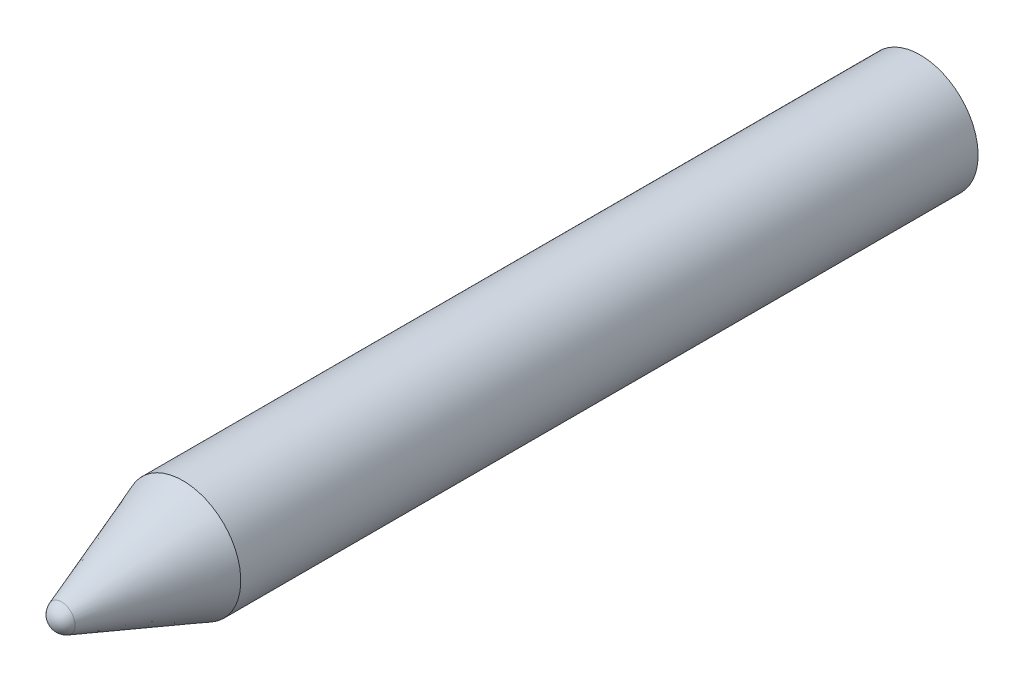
ISO-10303-21;
HEADER;
FILE_DESCRIPTION(('STEP AP214'),'2;1');
FILE_NAME('part.step','',(''),(''),'','','');
FILE_SCHEMA(('AUTOMOTIVE_DESIGN { 1 0 10303 214 1 1 1 1 }'));
ENDSEC;
DATA;
#1=APPLICATION_CONTEXT('core data for automotive mechanical design processes');
#2=APPLICATION_PROTOCOL_DEFINITION('international standard','automotive_design',2000,#1);
#3=PRODUCT_CONTEXT('',#1,'mechanical');
#4=PRODUCT('Part','Part','',(#3));
#5=PRODUCT_RELATED_PRODUCT_CATEGORY('part','',(#4));
#6=PRODUCT_DEFINITION_FORMATION('','',#4);
#7=PRODUCT_DEFINITION_CONTEXT('part definition',#1,'design');
#8=PRODUCT_DEFINITION('design','',#6,#7);
#9=PRODUCT_DEFINITION_SHAPE('','',#8);
#10=(LENGTH_UNIT() NAMED_UNIT(*) SI_UNIT(.MILLI.,.METRE.));
#11=(NAMED_UNIT(*) PLANE_ANGLE_UNIT() SI_UNIT($,.RADIAN.));
#12=(NAMED_UNIT(*) SI_UNIT($,.STERADIAN.) SOLID_ANGLE_UNIT());
#13=UNCERTAINTY_MEASURE_WITH_UNIT(LENGTH_MEASURE(1.E-05),#10,'distance_accuracy_value','');
#14=(GEOMETRIC_REPRESENTATION_CONTEXT(3) GLOBAL_UNCERTAINTY_ASSIGNED_CONTEXT((#13)) GLOBAL_UNIT_ASSIGNED_CONTEXT((#10,
#11,#12)) REPRESENTATION_CONTEXT('',''));
#15=CARTESIAN_POINT('',(0.,0.,0.));
#16=DIRECTION('',(0.,0.,1.));
#17=DIRECTION('',(1.,0.,0.));
#18=AXIS2_PLACEMENT_3D('',#15,#16,#17);
#19=CARTESIAN_POINT('',(0.,0.,-93.0628727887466));
#20=DIRECTION('',(0.,0.,-1.));
#21=DIRECTION('',(-1.,0.,0.));
#22=AXIS2_PLACEMENT_3D('',#19,#20,#21);
#23=CYLINDRICAL_SURFACE('',#22,7.99999999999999);
#24=CARTESIAN_POINT('',(0.,0.,33.7737066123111));
#25=DIRECTION('',(0.,0.,-1.));
#26=DIRECTION('',(-1.,0.,0.));
#27=AXIS2_PLACEMENT_3D('',#24,#25,#26);
#28=CIRCLE('',#27,7.99999999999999);
#29=CARTESIAN_POINT('',(-7.99999999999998,0.,33.7737066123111));
#30=VERTEX_POINT('',#29);
#31=EDGE_CURVE('E40',#30,#30,#28,.T.);
#32=ORIENTED_EDGE('',*,*,#31,.T.);
#33=EDGE_LOOP('',(#32));
#34=FACE_BOUND('',#33,.T.);
#35=CARTESIAN_POINT('',(0.,0.,-68.1337340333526));
#36=DIRECTION('',(0.,0.,-1.));
#37=DIRECTION('',(-1.,0.,0.));
#38=AXIS2_PLACEMENT_3D('',#35,#36,#37);
#39=CIRCLE('',#38,7.99999999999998);
#40=CARTESIAN_POINT('',(-7.99999999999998,0.,-68.1337340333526));
#41=VERTEX_POINT('',#40);
#42=EDGE_CURVE('E10',#41,#41,#39,.T.);
#43=ORIENTED_EDGE('',*,*,#42,.F.);
#44=EDGE_LOOP('',(#43));
#45=FACE_BOUND('',#44,.T.);
#46=ADVANCED_FACE('F30',(#34,#45),#23,.T.);
#47=CARTESIAN_POINT('',(-7.99999999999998,0.,-68.1337340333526));
#48=DIRECTION('',(0.,0.,-1.));
#49=DIRECTION('',(-1.,0.,0.));
#50=AXIS2_PLACEMENT_3D('',#47,#48,#49);
#51=PLANE('',#50);
#52=ORIENTED_EDGE('',*,*,#42,.T.);
#53=EDGE_LOOP('',(#52));
#54=FACE_BOUND('',#53,.T.);
#55=ADVANCED_FACE('F56',(#54),#51,.T.);
#56=CARTESIAN_POINT('',(0.,0.,49.8662659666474));
#57=DIRECTION('',(0.,0.,-1.));
#58=DIRECTION('',(-1.,0.,0.));
#59=AXIS2_PLACEMENT_3D('',#56,#57,#58);
#60=SPHERICAL_SURFACE('',#59,2.);
#61=CARTESIAN_POINT('',(0.,0.,50.5517331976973));
#62=DIRECTION('',(0.,0.,-1.));
#63=DIRECTION('',(-1.,0.,0.));
#64=AXIS2_PLACEMENT_3D('',#61,#62,#63);
#65=CIRCLE('',#64,1.8788652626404);
#66=CARTESIAN_POINT('',(-1.87886526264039,0.,50.5517331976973));
#67=VERTEX_POINT('',#66);
#68=EDGE_CURVE('E36',#67,#67,#65,.T.);
#69=ORIENTED_EDGE('',*,*,#68,.F.);
#70=EDGE_LOOP('',(#69));
#71=FACE_BOUND('',#70,.T.);
#72=ADVANCED_FACE('F51',(#71),#60,.T.);
#73=CARTESIAN_POINT('',(0.,0.,33.7737066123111));
#74=DIRECTION('',(0.,0.,-1.));
#75=DIRECTION('',(-1.,0.,0.));
#76=AXIS2_PLACEMENT_3D('',#73,#74,#75);
#77=CONICAL_SURFACE('',#76,7.99999999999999,0.349825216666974);
#78=CARTESIAN_POINT('',(-1.87886526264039,0.,50.5517331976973));
#79=CARTESIAN_POINT('',(-1.94262708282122,0.,50.3769620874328));
#80=CARTESIAN_POINT('',(-2.00638890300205,0.,50.2021909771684));
#81=CARTESIAN_POINT('',(-2.13391254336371,0.,49.8526487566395));
#82=CARTESIAN_POINT('',(-2.19767436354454,0.,49.6778776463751));
#83=CARTESIAN_POINT('',(-2.3251980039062,0.,49.3283354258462));
#84=CARTESIAN_POINT('',(-2.38895982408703,0.,49.1535643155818));
#85=CARTESIAN_POINT('',(-2.51648346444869,0.,48.8040220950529));
#86=CARTESIAN_POINT('',(-2.58024528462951,0.,48.6292509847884));
#87=CARTESIAN_POINT('',(-2.70776892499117,0.,48.2797087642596));
#88=CARTESIAN_POINT('',(-2.771530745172,0.,48.1049376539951));
#89=CARTESIAN_POINT('',(-2.89905438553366,0.,47.7553954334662));
#90=CARTESIAN_POINT('',(-2.96281620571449,0.,47.5806243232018));
#91=CARTESIAN_POINT('',(-3.09033984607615,0.,47.2310821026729));
#92=CARTESIAN_POINT('',(-3.15410166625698,0.,47.0563109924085));
#93=CARTESIAN_POINT('',(-3.28162530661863,0.,46.7067687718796));
#94=CARTESIAN_POINT('',(-3.34538712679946,0.,46.5319976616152));
#95=CARTESIAN_POINT('',(-3.47291076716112,0.,46.1824554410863));
#96=CARTESIAN_POINT('',(-3.53667258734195,0.,46.0076843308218));
#97=CARTESIAN_POINT('',(-3.66419622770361,0.,45.658142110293));
#98=CARTESIAN_POINT('',(-3.72795804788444,0.,45.4833710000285));
#99=CARTESIAN_POINT('',(-3.85548168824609,0.,45.1338287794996));
#100=CARTESIAN_POINT('',(-3.91924350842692,0.,44.9590576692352));
#101=CARTESIAN_POINT('',(-4.04676714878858,0.,44.6095154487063));
#102=CARTESIAN_POINT('',(-4.11052896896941,0.,44.4347443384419));
#103=CARTESIAN_POINT('',(-4.23805260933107,0.,44.085202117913));
#104=CARTESIAN_POINT('',(-4.3018144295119,0.,43.9104310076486));
#105=CARTESIAN_POINT('',(-4.42933806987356,0.,43.5608887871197));
#106=CARTESIAN_POINT('',(-4.49309989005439,0.,43.3861176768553));
#107=CARTESIAN_POINT('',(-4.62062353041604,0.,43.0365754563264));
#108=CARTESIAN_POINT('',(-4.68438535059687,0.,42.8618043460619));
#109=CARTESIAN_POINT('',(-4.81190899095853,0.,42.512262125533));
#110=CARTESIAN_POINT('',(-4.87567081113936,0.,42.3374910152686));
#111=CARTESIAN_POINT('',(-5.00319445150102,0.,41.9879487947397));
#112=CARTESIAN_POINT('',(-5.06695627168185,0.,41.8131776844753));
#113=CARTESIAN_POINT('',(-5.19447991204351,0.,41.4636354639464));
#114=CARTESIAN_POINT('',(-5.25824173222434,0.,41.288864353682));
#115=CARTESIAN_POINT('',(-5.38576537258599,0.,40.9393221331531));
#116=CARTESIAN_POINT('',(-5.44952719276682,0.,40.7645510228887));
#117=CARTESIAN_POINT('',(-5.57705083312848,0.,40.4150088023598));
#118=CARTESIAN_POINT('',(-5.64081265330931,0.,40.2402376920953));
#119=CARTESIAN_POINT('',(-5.76833629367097,0.,39.8906954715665));
#120=CARTESIAN_POINT('',(-5.8320981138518,0.,39.715924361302));
#121=CARTESIAN_POINT('',(-5.95962175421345,0.,39.3663821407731));
#122=CARTESIAN_POINT('',(-6.02338357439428,0.,39.1916110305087));
#123=CARTESIAN_POINT('',(-6.15090721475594,0.,38.8420688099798));
#124=CARTESIAN_POINT('',(-6.21466903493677,0.,38.6672976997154));
#125=CARTESIAN_POINT('',(-6.34219267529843,0.,38.3177554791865));
#126=CARTESIAN_POINT('',(-6.40595449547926,0.,38.1429843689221));
#127=CARTESIAN_POINT('',(-6.53347813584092,0.,37.7934421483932));
#128=CARTESIAN_POINT('',(-6.59723995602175,0.,37.6186710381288));
#129=CARTESIAN_POINT('',(-6.7247635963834,0.,37.2691288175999));
#130=CARTESIAN_POINT('',(-6.78852541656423,0.,37.0943577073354));
#131=CARTESIAN_POINT('',(-6.91604905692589,0.,36.7448154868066));
#132=CARTESIAN_POINT('',(-6.97981087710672,0.,36.5700443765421));
#133=CARTESIAN_POINT('',(-7.10733451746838,0.,36.2205021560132));
#134=CARTESIAN_POINT('',(-7.17109633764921,0.,36.0457310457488));
#135=CARTESIAN_POINT('',(-7.29861997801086,0.,35.6961888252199));
#136=CARTESIAN_POINT('',(-7.36238179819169,0.,35.5214177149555));
#137=CARTESIAN_POINT('',(-7.48990543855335,0.,35.1718754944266));
#138=CARTESIAN_POINT('',(-7.55366725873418,0.,34.9971043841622));
#139=CARTESIAN_POINT('',(-7.68119089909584,0.,34.6475621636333));
#140=CARTESIAN_POINT('',(-7.74495271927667,0.,34.4727910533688));
#141=CARTESIAN_POINT('',(-7.87247635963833,0.,34.12324883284));
#142=CARTESIAN_POINT('',(-7.93623817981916,0.,33.9484777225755));
#143=CARTESIAN_POINT('',(-7.99999999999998,0.,33.7737066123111));
#144=B_SPLINE_CURVE_WITH_KNOTS('',3,(#78,#79,#80,#81,#82,#83,#84,#85,#86,#87,#88,#89,#90,#91,
#92,#93,#94,#95,#96,#97,#98,#99,#100,#101,#102,#103,#104,#105,#106,#107,#108,#109,#110,#111,
#112,#113,#114,#115,#116,#117,#118,#119,#120,#121,#122,#123,#124,#125,#126,#127,#128,#129,#130,
#131,#132,#133,#134,#135,#136,#137,#138,#139,#140,#141,#142,#143),.UNSPECIFIED.,.F.,.F.,(4,2,2,
2,2,2,2,2,2,2,2,2,2,2,2,2,2,2,2,2,2,2,2,2,2,2,2,2,2,2,2,2,4),(0.,0.558117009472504,
1.11623401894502,1.67435102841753,2.23246803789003,2.79058504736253,3.34870205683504,
3.90681906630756,4.46493607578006,5.02305308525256,5.58117009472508,6.13928710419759,
6.69740411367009,7.2555211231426,7.81363813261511,8.37175514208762,8.92987215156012,
9.48798916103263,10.0461061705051,10.6042231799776,11.1623401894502,11.7204571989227,
12.2785742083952,12.8366912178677,13.3948082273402,13.9529252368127,14.5110422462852,
15.0691592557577,15.6272762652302,16.1853932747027,16.7435102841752,17.3016272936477,
17.8597443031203),.UNSPECIFIED.);
#145=EDGE_CURVE('BSEAM49',#67,#30,#144,.T.);
#146=ORIENTED_EDGE('',*,*,#68,.T.);
#147=ORIENTED_EDGE('',*,*,#31,.F.);
#148=ORIENTED_EDGE('',*,*,#145,.T.);
#149=ORIENTED_EDGE('',*,*,#145,.F.);
#150=EDGE_LOOP('',(#146,#148,#147,#149));
#151=FACE_BOUND('',#150,.T.);
#152=ADVANCED_FACE('F49',(#151),#77,.T.);
#153=CLOSED_SHELL('',(#46,#55,#72,#152));
#154=MANIFOLD_SOLID_BREP('B2',#153);
#155=ADVANCED_BREP_SHAPE_REPRESENTATION('',(#18,#154),#14);
#156=SHAPE_DEFINITION_REPRESENTATION(#9,#155);
ENDSEC;
END-ISO-10303-21;
